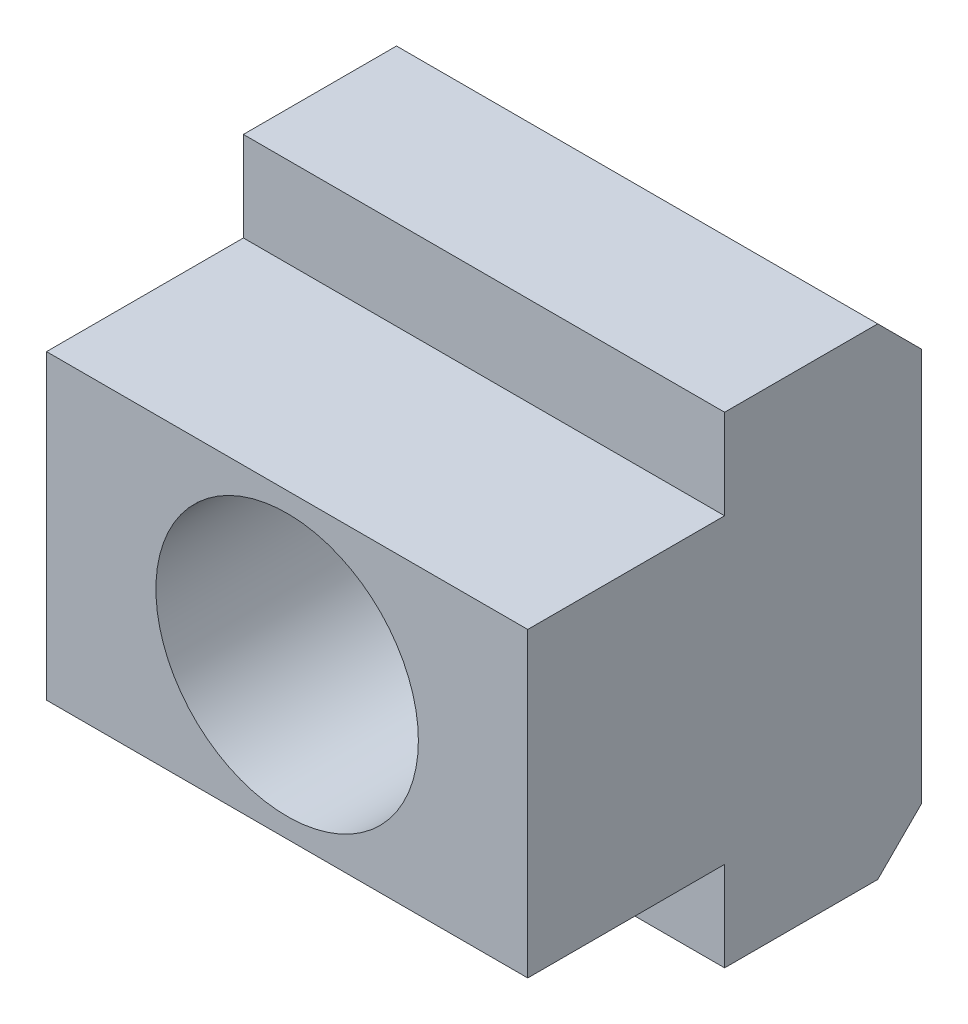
ISO-10303-21;
HEADER;
FILE_DESCRIPTION(('STEP AP214'),'2;1');
FILE_NAME('part.step','',(''),(''),'','','');
FILE_SCHEMA(('AUTOMOTIVE_DESIGN { 1 0 10303 214 1 1 1 1 }'));
ENDSEC;
DATA;
#1=APPLICATION_CONTEXT('core data for automotive mechanical design processes');
#2=APPLICATION_PROTOCOL_DEFINITION('international standard','automotive_design',2000,#1);
#3=PRODUCT_CONTEXT('',#1,'mechanical');
#4=PRODUCT('Part','Part','',(#3));
#5=PRODUCT_RELATED_PRODUCT_CATEGORY('part','',(#4));
#6=PRODUCT_DEFINITION_FORMATION('','',#4);
#7=PRODUCT_DEFINITION_CONTEXT('part definition',#1,'design');
#8=PRODUCT_DEFINITION('design','',#6,#7);
#9=PRODUCT_DEFINITION_SHAPE('','',#8);
#10=(LENGTH_UNIT() NAMED_UNIT(*) SI_UNIT(.MILLI.,.METRE.));
#11=(NAMED_UNIT(*) PLANE_ANGLE_UNIT() SI_UNIT($,.RADIAN.));
#12=(NAMED_UNIT(*) SI_UNIT($,.STERADIAN.) SOLID_ANGLE_UNIT());
#13=UNCERTAINTY_MEASURE_WITH_UNIT(LENGTH_MEASURE(1.E-05),#10,'distance_accuracy_value','');
#14=(GEOMETRIC_REPRESENTATION_CONTEXT(3) GLOBAL_UNCERTAINTY_ASSIGNED_CONTEXT((#13)) GLOBAL_UNIT_ASSIGNED_CONTEXT((#10,
#11,#12)) REPRESENTATION_CONTEXT('',''));
#15=CARTESIAN_POINT('',(0.,0.,0.));
#16=DIRECTION('',(0.,0.,1.));
#17=DIRECTION('',(1.,0.,0.));
#18=AXIS2_PLACEMENT_3D('',#15,#16,#17);
#19=CARTESIAN_POINT('',(22.,13.8,0.));
#20=DIRECTION('',(0.,-1.,0.));
#21=DIRECTION('',(0.,0.,-1.));
#22=AXIS2_PLACEMENT_3D('',#19,#20,#21);
#23=PLANE('',#22);
#24=DIRECTION('',(0.,0.,1.));
#25=VECTOR('',#24,1.);
#26=CARTESIAN_POINT('',(-22.,13.8,0.));
#27=LINE('',#26,#25);
#28=CARTESIAN_POINT('',(-22.,13.8,0.));
#29=VERTEX_POINT('',#28);
#30=CARTESIAN_POINT('',(-22.,13.8,18.));
#31=VERTEX_POINT('',#30);
#32=EDGE_CURVE('E121',#29,#31,#27,.T.);
#33=ORIENTED_EDGE('',*,*,#32,.T.);
#34=DIRECTION('',(-1.,0.,0.));
#35=VECTOR('',#34,1.);
#36=CARTESIAN_POINT('',(22.,13.8,18.));
#37=LINE('',#36,#35);
#38=CARTESIAN_POINT('',(22.,13.8,18.));
#39=VERTEX_POINT('',#38);
#40=EDGE_CURVE('E143',#39,#31,#37,.T.);
#41=ORIENTED_EDGE('',*,*,#40,.F.);
#42=DIRECTION('',(0.,0.,1.));
#43=VECTOR('',#42,1.);
#44=CARTESIAN_POINT('',(22.,13.8,0.));
#45=LINE('',#44,#43);
#46=CARTESIAN_POINT('',(22.,13.8,0.));
#47=VERTEX_POINT('',#46);
#48=EDGE_CURVE('E135',#47,#39,#45,.T.);
#49=ORIENTED_EDGE('',*,*,#48,.F.);
#50=DIRECTION('',(-1.,0.,0.));
#51=VECTOR('',#50,1.);
#52=CARTESIAN_POINT('',(22.,13.8,0.));
#53=LINE('',#52,#51);
#54=EDGE_CURVE('E120',#47,#29,#53,.T.);
#55=ORIENTED_EDGE('',*,*,#54,.T.);
#56=EDGE_LOOP('',(#33,#41,#49,#55));
#57=FACE_BOUND('',#56,.T.);
#58=ADVANCED_FACE('F14',(#57),#23,.F.);
#59=CARTESIAN_POINT('',(22.,13.8,18.));
#60=DIRECTION('',(0.,0.,-1.));
#61=DIRECTION('',(-1.,0.,0.));
#62=AXIS2_PLACEMENT_3D('',#59,#60,#61);
#63=PLANE('',#62);
#64=CARTESIAN_POINT('',(0.,0.,18.));
#65=DIRECTION('',(0.,0.,1.));
#66=DIRECTION('',(1.,0.,0.));
#67=AXIS2_PLACEMENT_3D('',#64,#65,#66);
#68=CIRCLE('',#67,12.);
#69=CARTESIAN_POINT('',(12.,0.,18.));
#70=VERTEX_POINT('',#69);
#71=EDGE_CURVE('E191',#70,#70,#68,.T.);
#72=ORIENTED_EDGE('',*,*,#71,.F.);
#73=EDGE_LOOP('',(#72));
#74=FACE_BOUND('',#73,.T.);
#75=DIRECTION('',(0.,-1.,0.));
#76=VECTOR('',#75,1.);
#77=CARTESIAN_POINT('',(-22.,13.8,18.));
#78=LINE('',#77,#76);
#79=CARTESIAN_POINT('',(-22.,-13.8,18.));
#80=VERTEX_POINT('',#79);
#81=EDGE_CURVE('E124',#31,#80,#78,.T.);
#82=ORIENTED_EDGE('',*,*,#81,.T.);
#83=DIRECTION('',(-1.,0.,0.));
#84=VECTOR('',#83,1.);
#85=CARTESIAN_POINT('',(22.,-13.8,18.));
#86=LINE('',#85,#84);
#87=CARTESIAN_POINT('',(22.,-13.8,18.));
#88=VERTEX_POINT('',#87);
#89=EDGE_CURVE('E140',#88,#80,#86,.T.);
#90=ORIENTED_EDGE('',*,*,#89,.F.);
#91=DIRECTION('',(0.,-1.,0.));
#92=VECTOR('',#91,1.);
#93=CARTESIAN_POINT('',(22.,13.8,18.));
#94=LINE('',#93,#92);
#95=EDGE_CURVE('E115',#39,#88,#94,.T.);
#96=ORIENTED_EDGE('',*,*,#95,.F.);
#97=ORIENTED_EDGE('',*,*,#40,.T.);
#98=EDGE_LOOP('',(#82,#90,#96,#97));
#99=FACE_BOUND('',#98,.T.);
#100=ADVANCED_FACE('F206',(#74,#99),#63,.F.);
#101=CARTESIAN_POINT('',(22.,-13.8,18.));
#102=DIRECTION('',(0.,1.,0.));
#103=DIRECTION('',(0.,0.,1.));
#104=AXIS2_PLACEMENT_3D('',#101,#102,#103);
#105=PLANE('',#104);
#106=DIRECTION('',(0.,0.,-1.));
#107=VECTOR('',#106,1.);
#108=CARTESIAN_POINT('',(-22.,-13.8,18.));
#109=LINE('',#108,#107);
#110=CARTESIAN_POINT('',(-22.,-13.8,0.));
#111=VERTEX_POINT('',#110);
#112=EDGE_CURVE('E127',#80,#111,#109,.T.);
#113=ORIENTED_EDGE('',*,*,#112,.T.);
#114=DIRECTION('',(-1.,0.,0.));
#115=VECTOR('',#114,1.);
#116=CARTESIAN_POINT('',(22.,-13.8,0.));
#117=LINE('',#116,#115);
#118=CARTESIAN_POINT('',(22.,-13.8,0.));
#119=VERTEX_POINT('',#118);
#120=EDGE_CURVE('E138',#119,#111,#117,.T.);
#121=ORIENTED_EDGE('',*,*,#120,.F.);
#122=DIRECTION('',(0.,0.,-1.));
#123=VECTOR('',#122,1.);
#124=CARTESIAN_POINT('',(22.,-13.8,18.));
#125=LINE('',#124,#123);
#126=EDGE_CURVE('E109',#88,#119,#125,.T.);
#127=ORIENTED_EDGE('',*,*,#126,.F.);
#128=ORIENTED_EDGE('',*,*,#89,.T.);
#129=EDGE_LOOP('',(#113,#121,#127,#128));
#130=FACE_BOUND('',#129,.T.);
#131=ADVANCED_FACE('F209',(#130),#105,.F.);
#132=CARTESIAN_POINT('',(22.,-13.8,0.));
#133=DIRECTION('',(0.,0.,-1.));
#134=DIRECTION('',(0.,1.,0.));
#135=AXIS2_PLACEMENT_3D('',#132,#133,#134);
#136=PLANE('',#135);
#137=DIRECTION('',(0.,-1.,0.));
#138=VECTOR('',#137,1.);
#139=CARTESIAN_POINT('',(-22.,-13.8,0.));
#140=LINE('',#139,#138);
#141=CARTESIAN_POINT('',(-22.,-22.,0.));
#142=VERTEX_POINT('',#141);
#143=EDGE_CURVE('E104',#111,#142,#140,.T.);
#144=ORIENTED_EDGE('',*,*,#143,.T.);
#145=DIRECTION('',(1.,0.,0.));
#146=VECTOR('',#145,1.);
#147=CARTESIAN_POINT('',(22.,-22.,0.));
#148=LINE('',#147,#146);
#149=CARTESIAN_POINT('',(22.,-22.,0.));
#150=VERTEX_POINT('',#149);
#151=EDGE_CURVE('E93',#142,#150,#148,.T.);
#152=ORIENTED_EDGE('',*,*,#151,.T.);
#153=DIRECTION('',(0.,-1.,0.));
#154=VECTOR('',#153,1.);
#155=CARTESIAN_POINT('',(22.,-13.8,0.));
#156=LINE('',#155,#154);
#157=EDGE_CURVE('E102',#119,#150,#156,.T.);
#158=ORIENTED_EDGE('',*,*,#157,.F.);
#159=ORIENTED_EDGE('',*,*,#120,.T.);
#160=EDGE_LOOP('',(#144,#152,#158,#159));
#161=FACE_BOUND('',#160,.T.);
#162=ADVANCED_FACE('F100',(#161),#136,.F.);
#163=CARTESIAN_POINT('',(22.,-22.7996519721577,-18.));
#164=DIRECTION('',(0.,0.,1.));
#165=DIRECTION('',(1.,0.,0.));
#166=AXIS2_PLACEMENT_3D('',#163,#164,#165);
#167=PLANE('',#166);
#168=CARTESIAN_POINT('',(0.,0.,-18.));
#169=DIRECTION('',(0.,0.,1.));
#170=DIRECTION('',(1.,0.,0.));
#171=AXIS2_PLACEMENT_3D('',#168,#169,#170);
#172=CIRCLE('',#171,12.);
#173=CARTESIAN_POINT('',(12.,0.,-18.));
#174=VERTEX_POINT('',#173);
#175=EDGE_CURVE('E125',#174,#174,#172,.T.);
#176=ORIENTED_EDGE('',*,*,#175,.T.);
#177=EDGE_LOOP('',(#176));
#178=FACE_BOUND('',#177,.T.);
#179=DIRECTION('',(0.,1.,0.));
#180=VECTOR('',#179,1.);
#181=CARTESIAN_POINT('',(22.,-22.7996519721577,-18.));
#182=LINE('',#181,#180);
#183=CARTESIAN_POINT('',(22.,-18.,-18.));
#184=VERTEX_POINT('',#183);
#185=CARTESIAN_POINT('',(22.,18.,-18.));
#186=VERTEX_POINT('',#185);
#187=EDGE_CURVE('E111',#184,#186,#182,.T.);
#188=ORIENTED_EDGE('',*,*,#187,.F.);
#189=DIRECTION('',(-1.,0.,0.));
#190=VECTOR('',#189,1.);
#191=CARTESIAN_POINT('',(22.,-18.,-18.));
#192=LINE('',#191,#190);
#193=CARTESIAN_POINT('',(-22.,-18.,-18.));
#194=VERTEX_POINT('',#193);
#195=EDGE_CURVE('E154',#184,#194,#192,.T.);
#196=ORIENTED_EDGE('',*,*,#195,.T.);
#197=DIRECTION('',(0.,1.,0.));
#198=VECTOR('',#197,1.);
#199=CARTESIAN_POINT('',(-22.,-22.7996519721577,-18.));
#200=LINE('',#199,#198);
#201=CARTESIAN_POINT('',(-22.,18.,-18.));
#202=VERTEX_POINT('',#201);
#203=EDGE_CURVE('E130',#194,#202,#200,.T.);
#204=ORIENTED_EDGE('',*,*,#203,.T.);
#205=DIRECTION('',(1.,0.,0.));
#206=VECTOR('',#205,1.);
#207=CARTESIAN_POINT('',(22.,18.,-18.));
#208=LINE('',#207,#206);
#209=EDGE_CURVE('E151',#202,#186,#208,.T.);
#210=ORIENTED_EDGE('',*,*,#209,.T.);
#211=EDGE_LOOP('',(#188,#196,#204,#210));
#212=FACE_BOUND('',#211,.T.);
#213=ADVANCED_FACE('F166',(#178,#212),#167,.F.);
#214=CARTESIAN_POINT('',(22.,27.8015081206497,0.));
#215=DIRECTION('',(0.,0.,-1.));
#216=DIRECTION('',(0.,1.,0.));
#217=AXIS2_PLACEMENT_3D('',#214,#215,#216);
#218=PLANE('',#217);
#219=DIRECTION('',(0.,-1.,0.));
#220=VECTOR('',#219,1.);
#221=CARTESIAN_POINT('',(22.,27.8015081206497,0.));
#222=LINE('',#221,#220);
#223=CARTESIAN_POINT('',(22.,22.,0.));
#224=VERTEX_POINT('',#223);
#225=EDGE_CURVE('E113',#224,#47,#222,.T.);
#226=ORIENTED_EDGE('',*,*,#225,.F.);
#227=DIRECTION('',(-1.,0.,0.));
#228=VECTOR('',#227,1.);
#229=CARTESIAN_POINT('',(22.,22.,0.));
#230=LINE('',#229,#228);
#231=CARTESIAN_POINT('',(-22.,22.,0.));
#232=VERTEX_POINT('',#231);
#233=EDGE_CURVE('E185',#224,#232,#230,.T.);
#234=ORIENTED_EDGE('',*,*,#233,.T.);
#235=DIRECTION('',(0.,-1.,0.));
#236=VECTOR('',#235,1.);
#237=CARTESIAN_POINT('',(-22.,27.8015081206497,0.));
#238=LINE('',#237,#236);
#239=EDGE_CURVE('E133',#232,#29,#238,.T.);
#240=ORIENTED_EDGE('',*,*,#239,.T.);
#241=ORIENTED_EDGE('',*,*,#54,.F.);
#242=EDGE_LOOP('',(#226,#234,#240,#241));
#243=FACE_BOUND('',#242,.T.);
#244=ADVANCED_FACE('F183',(#243),#218,.F.);
#245=CARTESIAN_POINT('',(22.,13.8,0.));
#246=DIRECTION('',(1.,0.,0.));
#247=DIRECTION('',(0.,0.,-1.));
#248=AXIS2_PLACEMENT_3D('',#245,#246,#247);
#249=PLANE('',#248);
#250=DIRECTION('',(0.,0.,1.));
#251=VECTOR('',#250,1.);
#252=CARTESIAN_POINT('',(22.,-22.,2.27504833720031));
#253=LINE('',#252,#251);
#254=CARTESIAN_POINT('',(22.,-22.,-14.));
#255=VERTEX_POINT('',#254);
#256=EDGE_CURVE('E90',#255,#150,#253,.T.);
#257=ORIENTED_EDGE('',*,*,#256,.F.);
#258=DIRECTION('',(0.,-0.707106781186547,0.707106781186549));
#259=VECTOR('',#258,1.);
#260=CARTESIAN_POINT('',(22.,-11.1,-24.9));
#261=LINE('',#260,#259);
#262=EDGE_CURVE('E22',#255,#184,#261,.F.);
#263=ORIENTED_EDGE('',*,*,#262,.T.);
#264=ORIENTED_EDGE('',*,*,#187,.T.);
#265=DIRECTION('',(0.,-0.707106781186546,-0.707106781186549));
#266=VECTOR('',#265,1.);
#267=CARTESIAN_POINT('',(22.,24.9,-11.1));
#268=LINE('',#267,#266);
#269=CARTESIAN_POINT('',(22.,22.,-14.));
#270=VERTEX_POINT('',#269);
#271=EDGE_CURVE('E29',#186,#270,#268,.F.);
#272=ORIENTED_EDGE('',*,*,#271,.T.);
#273=DIRECTION('',(0.,0.,-1.));
#274=VECTOR('',#273,1.);
#275=CARTESIAN_POINT('',(22.,22.,2.27504833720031));
#276=LINE('',#275,#274);
#277=EDGE_CURVE('E105',#224,#270,#276,.T.);
#278=ORIENTED_EDGE('',*,*,#277,.F.);
#279=ORIENTED_EDGE('',*,*,#225,.T.);
#280=ORIENTED_EDGE('',*,*,#48,.T.);
#281=ORIENTED_EDGE('',*,*,#95,.T.);
#282=ORIENTED_EDGE('',*,*,#126,.T.);
#283=ORIENTED_EDGE('',*,*,#157,.T.);
#284=EDGE_LOOP('',(#257,#263,#264,#272,#278,#279,#280,#281,#282,#283));
#285=FACE_BOUND('',#284,.T.);
#286=ADVANCED_FACE('F107',(#285),#249,.T.);
#287=CARTESIAN_POINT('',(-22.,13.8,0.));
#288=DIRECTION('',(1.,0.,0.));
#289=DIRECTION('',(0.,0.,-1.));
#290=AXIS2_PLACEMENT_3D('',#287,#288,#289);
#291=PLANE('',#290);
#292=ORIENTED_EDGE('',*,*,#203,.F.);
#293=DIRECTION('',(0.,0.707106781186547,-0.707106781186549));
#294=VECTOR('',#293,1.);
#295=CARTESIAN_POINT('',(-22.,-18.,-18.));
#296=LINE('',#295,#294);
#297=CARTESIAN_POINT('',(-22.,-22.,-14.));
#298=VERTEX_POINT('',#297);
#299=EDGE_CURVE('E159',#194,#298,#296,.F.);
#300=ORIENTED_EDGE('',*,*,#299,.T.);
#301=DIRECTION('',(0.,0.,1.));
#302=VECTOR('',#301,1.);
#303=CARTESIAN_POINT('',(-22.,-22.,0.));
#304=LINE('',#303,#302);
#305=EDGE_CURVE('E149',#298,#142,#304,.T.);
#306=ORIENTED_EDGE('',*,*,#305,.T.);
#307=ORIENTED_EDGE('',*,*,#143,.F.);
#308=ORIENTED_EDGE('',*,*,#112,.F.);
#309=ORIENTED_EDGE('',*,*,#81,.F.);
#310=ORIENTED_EDGE('',*,*,#32,.F.);
#311=ORIENTED_EDGE('',*,*,#239,.F.);
#312=DIRECTION('',(0.,0.,-1.));
#313=VECTOR('',#312,1.);
#314=CARTESIAN_POINT('',(-22.,22.,0.));
#315=LINE('',#314,#313);
#316=CARTESIAN_POINT('',(-22.,22.,-14.));
#317=VERTEX_POINT('',#316);
#318=EDGE_CURVE('E146',#232,#317,#315,.T.);
#319=ORIENTED_EDGE('',*,*,#318,.T.);
#320=DIRECTION('',(0.,0.707106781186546,0.707106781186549));
#321=VECTOR('',#320,1.);
#322=CARTESIAN_POINT('',(-22.,18.,-18.));
#323=LINE('',#322,#321);
#324=EDGE_CURVE('E157',#317,#202,#323,.F.);
#325=ORIENTED_EDGE('',*,*,#324,.T.);
#326=EDGE_LOOP('',(#292,#300,#306,#307,#308,#309,#310,#311,#319,#325));
#327=FACE_BOUND('',#326,.T.);
#328=ADVANCED_FACE('F171',(#327),#291,.F.);
#329=CARTESIAN_POINT('',(0.,0.,-18.));
#330=DIRECTION('',(0.,0.,1.));
#331=DIRECTION('',(1.,0.,0.));
#332=AXIS2_PLACEMENT_3D('',#329,#330,#331);
#333=CYLINDRICAL_SURFACE('',#332,12.);
#334=ORIENTED_EDGE('',*,*,#175,.F.);
#335=EDGE_LOOP('',(#334));
#336=FACE_BOUND('',#335,.T.);
#337=ORIENTED_EDGE('',*,*,#71,.T.);
#338=EDGE_LOOP('',(#337));
#339=FACE_BOUND('',#338,.T.);
#340=ADVANCED_FACE('F200',(#336,#339),#333,.F.);
#341=CARTESIAN_POINT('',(-22.,22.,2.27504833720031));
#342=DIRECTION('',(0.,-1.,0.));
#343=DIRECTION('',(0.,0.,-1.));
#344=AXIS2_PLACEMENT_3D('',#341,#342,#343);
#345=PLANE('',#344);
#346=ORIENTED_EDGE('',*,*,#277,.T.);
#347=DIRECTION('',(-1.,0.,0.));
#348=VECTOR('',#347,1.);
#349=CARTESIAN_POINT('',(-22.,22.,-14.));
#350=LINE('',#349,#348);
#351=EDGE_CURVE('E9',#270,#317,#350,.T.);
#352=ORIENTED_EDGE('',*,*,#351,.T.);
#353=ORIENTED_EDGE('',*,*,#318,.F.);
#354=ORIENTED_EDGE('',*,*,#233,.F.);
#355=EDGE_LOOP('',(#346,#352,#353,#354));
#356=FACE_BOUND('',#355,.T.);
#357=ADVANCED_FACE('F176',(#356),#345,.F.);
#358=CARTESIAN_POINT('',(-22.,-22.,2.27504833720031));
#359=DIRECTION('',(0.,1.,0.));
#360=DIRECTION('',(0.,0.,1.));
#361=AXIS2_PLACEMENT_3D('',#358,#359,#360);
#362=PLANE('',#361);
#363=ORIENTED_EDGE('',*,*,#305,.F.);
#364=DIRECTION('',(1.,0.,0.));
#365=VECTOR('',#364,1.);
#366=CARTESIAN_POINT('',(-22.,-22.,-14.));
#367=LINE('',#366,#365);
#368=EDGE_CURVE('E37',#298,#255,#367,.T.);
#369=ORIENTED_EDGE('',*,*,#368,.T.);
#370=ORIENTED_EDGE('',*,*,#256,.T.);
#371=ORIENTED_EDGE('',*,*,#151,.F.);
#372=EDGE_LOOP('',(#363,#369,#370,#371));
#373=FACE_BOUND('',#372,.T.);
#374=ADVANCED_FACE('F92',(#373),#362,.F.);
#375=CARTESIAN_POINT('',(22.,-18.,-18.));
#376=DIRECTION('',(0.,0.707106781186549,0.707106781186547));
#377=DIRECTION('',(0.,-0.707106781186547,0.707106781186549));
#378=AXIS2_PLACEMENT_3D('',#375,#376,#377);
#379=PLANE('',#378);
#380=ORIENTED_EDGE('',*,*,#262,.F.);
#381=ORIENTED_EDGE('',*,*,#368,.F.);
#382=ORIENTED_EDGE('',*,*,#299,.F.);
#383=ORIENTED_EDGE('',*,*,#195,.F.);
#384=EDGE_LOOP('',(#380,#381,#382,#383));
#385=FACE_BOUND('',#384,.T.);
#386=ADVANCED_FACE('F169',(#385),#379,.F.);
#387=CARTESIAN_POINT('',(22.,18.,-18.));
#388=DIRECTION('',(0.,-0.707106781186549,0.707106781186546));
#389=DIRECTION('',(0.,-0.707106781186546,-0.707106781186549));
#390=AXIS2_PLACEMENT_3D('',#387,#388,#389);
#391=PLANE('',#390);
#392=ORIENTED_EDGE('',*,*,#324,.F.);
#393=ORIENTED_EDGE('',*,*,#351,.F.);
#394=ORIENTED_EDGE('',*,*,#271,.F.);
#395=ORIENTED_EDGE('',*,*,#209,.F.);
#396=EDGE_LOOP('',(#392,#393,#394,#395));
#397=FACE_BOUND('',#396,.T.);
#398=ADVANCED_FACE('F16',(#397),#391,.F.);
#399=CLOSED_SHELL('',(#58,#100,#131,#162,#213,#244,#286,#328,#340,#357,#374,#386,#398));
#400=MANIFOLD_SOLID_BREP('B1',#399);
#401=ADVANCED_BREP_SHAPE_REPRESENTATION('',(#18,#400),#14);
#402=SHAPE_DEFINITION_REPRESENTATION(#9,#401);
ENDSEC;
END-ISO-10303-21;
